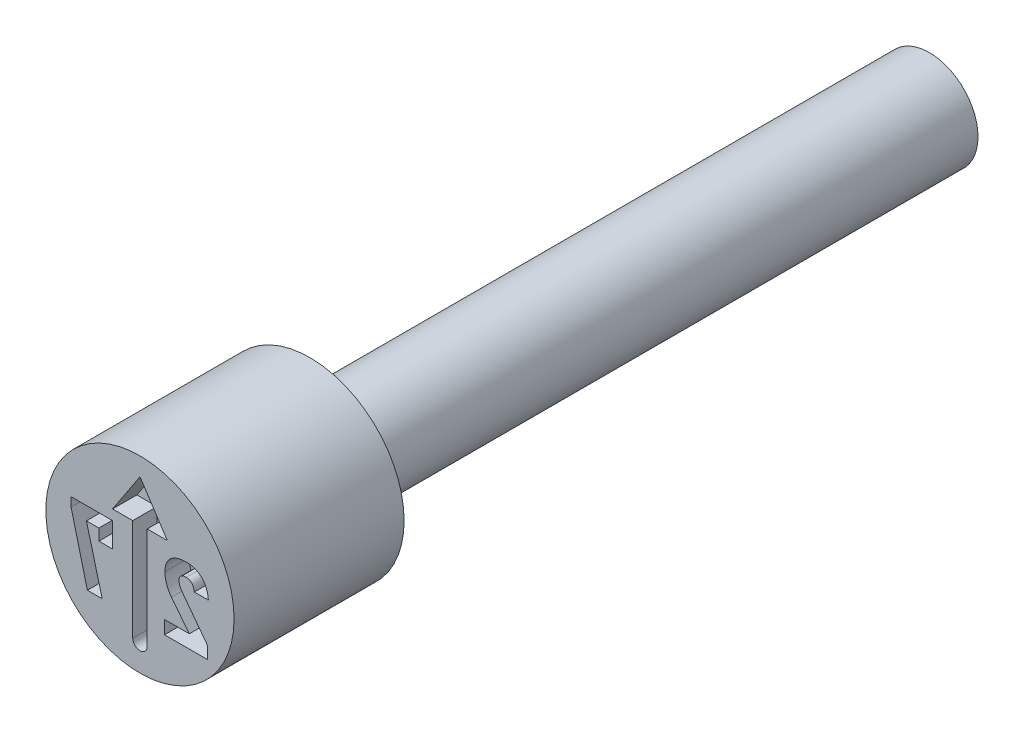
ISO-10303-21;
HEADER;
FILE_DESCRIPTION(('STEP AP214'),'2;1');
FILE_NAME('part.step','',(''),(''),'','','');
FILE_SCHEMA(('AUTOMOTIVE_DESIGN { 1 0 10303 214 1 1 1 1 }'));
ENDSEC;
DATA;
#1=APPLICATION_CONTEXT('core data for automotive mechanical design processes');
#2=APPLICATION_PROTOCOL_DEFINITION('international standard','automotive_design',2000,#1);
#3=PRODUCT_CONTEXT('',#1,'mechanical');
#4=PRODUCT('Part','Part','',(#3));
#5=PRODUCT_RELATED_PRODUCT_CATEGORY('part','',(#4));
#6=PRODUCT_DEFINITION_FORMATION('','',#4);
#7=PRODUCT_DEFINITION_CONTEXT('part definition',#1,'design');
#8=PRODUCT_DEFINITION('design','',#6,#7);
#9=PRODUCT_DEFINITION_SHAPE('','',#8);
#10=(LENGTH_UNIT() NAMED_UNIT(*) SI_UNIT(.MILLI.,.METRE.));
#11=(NAMED_UNIT(*) PLANE_ANGLE_UNIT() SI_UNIT($,.RADIAN.));
#12=(NAMED_UNIT(*) SI_UNIT($,.STERADIAN.) SOLID_ANGLE_UNIT());
#13=UNCERTAINTY_MEASURE_WITH_UNIT(LENGTH_MEASURE(1.E-05),#10,'distance_accuracy_value','');
#14=(GEOMETRIC_REPRESENTATION_CONTEXT(3) GLOBAL_UNCERTAINTY_ASSIGNED_CONTEXT((#13)) GLOBAL_UNIT_ASSIGNED_CONTEXT((#10,
#11,#12)) REPRESENTATION_CONTEXT('',''));
#15=CARTESIAN_POINT('',(0.,0.,0.));
#16=DIRECTION('',(0.,0.,1.));
#17=DIRECTION('',(1.,0.,0.));
#18=AXIS2_PLACEMENT_3D('',#15,#16,#17);
#19=CARTESIAN_POINT('',(0.,0.799999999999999,-2.8));
#20=DIRECTION('',(0.,0.,1.));
#21=DIRECTION('',(1.,0.,0.));
#22=AXIS2_PLACEMENT_3D('',#19,#20,#21);
#23=PLANE('',#22);
#24=CARTESIAN_POINT('',(0.,0.,-2.8));
#25=DIRECTION('',(0.,0.,1.));
#26=DIRECTION('',(1.,0.,0.));
#27=AXIS2_PLACEMENT_3D('',#24,#25,#26);
#28=CIRCLE('',#27,1.55);
#29=CARTESIAN_POINT('',(1.55,0.,-2.8));
#30=VERTEX_POINT('',#29);
#31=EDGE_CURVE('E11',#30,#30,#28,.T.);
#32=ORIENTED_EDGE('',*,*,#31,.F.);
#33=EDGE_LOOP('',(#32));
#34=FACE_BOUND('',#33,.T.);
#35=CARTESIAN_POINT('',(0.,0.,-2.8));
#36=DIRECTION('',(0.,0.,1.));
#37=DIRECTION('',(1.,0.,0.));
#38=AXIS2_PLACEMENT_3D('',#35,#36,#37);
#39=CIRCLE('',#38,0.799999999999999);
#40=CARTESIAN_POINT('',(0.799999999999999,0.,-2.8));
#41=VERTEX_POINT('',#40);
#42=EDGE_CURVE('E405',#41,#41,#39,.T.);
#43=ORIENTED_EDGE('',*,*,#42,.T.);
#44=EDGE_LOOP('',(#43));
#45=FACE_BOUND('',#44,.T.);
#46=ADVANCED_FACE('F39',(#34,#45),#23,.F.);
#47=CARTESIAN_POINT('',(0.,0.,-0.403888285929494));
#48=DIRECTION('',(0.,0.,1.));
#49=DIRECTION('',(1.,0.,0.));
#50=AXIS2_PLACEMENT_3D('',#47,#48,#49);
#51=CYLINDRICAL_SURFACE('',#50,1.55);
#52=CARTESIAN_POINT('',(0.,0.,0.));
#53=DIRECTION('',(0.,0.,1.));
#54=DIRECTION('',(1.,0.,0.));
#55=AXIS2_PLACEMENT_3D('',#52,#53,#54);
#56=CIRCLE('',#55,1.55);
#57=CARTESIAN_POINT('',(1.55,0.,0.));
#58=VERTEX_POINT('',#57);
#59=EDGE_CURVE('E46',#58,#58,#56,.T.);
#60=ORIENTED_EDGE('',*,*,#59,.F.);
#61=EDGE_LOOP('',(#60));
#62=FACE_BOUND('',#61,.T.);
#63=ORIENTED_EDGE('',*,*,#31,.T.);
#64=EDGE_LOOP('',(#63));
#65=FACE_BOUND('',#64,.T.);
#66=ADVANCED_FACE('F390',(#62,#65),#51,.T.);
#67=CARTESIAN_POINT('',(0.,1.55,0.));
#68=DIRECTION('',(0.,0.,-1.));
#69=DIRECTION('',(-1.,0.,0.));
#70=AXIS2_PLACEMENT_3D('',#67,#68,#69);
#71=PLANE('',#70);
#72=DIRECTION('',(0.,1.,0.));
#73=VECTOR('',#72,1.);
#74=CARTESIAN_POINT('',(1.11112012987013,-0.8,0.));
#75=LINE('',#74,#73);
#76=CARTESIAN_POINT('',(1.11112012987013,-0.8,0.));
#77=VERTEX_POINT('',#76);
#78=CARTESIAN_POINT('',(1.11112012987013,-0.595941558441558,0.));
#79=VERTEX_POINT('',#78);
#80=EDGE_CURVE('E640',#77,#79,#75,.T.);
#81=ORIENTED_EDGE('',*,*,#80,.F.);
#82=DIRECTION('',(1.,0.,0.));
#83=VECTOR('',#82,1.);
#84=CARTESIAN_POINT('',(0.404464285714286,-0.8,0.));
#85=LINE('',#84,#83);
#86=CARTESIAN_POINT('',(0.404464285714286,-0.8,0.));
#87=VERTEX_POINT('',#86);
#88=EDGE_CURVE('E53',#87,#77,#85,.T.);
#89=ORIENTED_EDGE('',*,*,#88,.F.);
#90=DIRECTION('',(0.,-1.,0.));
#91=VECTOR('',#90,1.);
#92=CARTESIAN_POINT('',(0.404464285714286,-0.581818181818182,0.));
#93=LINE('',#92,#91);
#94=CARTESIAN_POINT('',(0.404464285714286,-0.581818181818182,0.));
#95=VERTEX_POINT('',#94);
#96=EDGE_CURVE('E274',#95,#87,#93,.T.);
#97=ORIENTED_EDGE('',*,*,#96,.F.);
#98=DIRECTION('',(-1.,0.,0.));
#99=VECTOR('',#98,1.);
#100=CARTESIAN_POINT('',(0.812824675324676,-0.581818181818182,0.));
#101=LINE('',#100,#99);
#102=CARTESIAN_POINT('',(0.812824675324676,-0.581818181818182,0.));
#103=VERTEX_POINT('',#102);
#104=EDGE_CURVE('E277',#103,#95,#101,.T.);
#105=ORIENTED_EDGE('',*,*,#104,.F.);
#106=DIRECTION('',(0.618183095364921,-0.786034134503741,0.));
#107=VECTOR('',#106,1.);
#108=CARTESIAN_POINT('',(0.518668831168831,-0.207792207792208,0.));
#109=LINE('',#108,#107);
#110=CARTESIAN_POINT('',(0.518668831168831,-0.207792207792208,0.));
#111=VERTEX_POINT('',#110);
#112=EDGE_CURVE('E571',#111,#103,#109,.T.);
#113=ORIENTED_EDGE('',*,*,#112,.F.);
#114=CARTESIAN_POINT('',(0.411038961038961,0.100974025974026,0.));
#115=CARTESIAN_POINT('',(0.411349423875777,0.087320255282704,0.));
#116=CARTESIAN_POINT('',(0.411970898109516,0.0599885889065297,0.));
#117=CARTESIAN_POINT('',(0.417580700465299,0.019082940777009,0.));
#118=CARTESIAN_POINT('',(0.426620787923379,-0.0216138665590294,0.));
#119=CARTESIAN_POINT('',(0.439036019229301,-0.0619052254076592,0.));
#120=CARTESIAN_POINT('',(0.454458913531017,-0.101093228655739,0.));
#121=CARTESIAN_POINT('',(0.472969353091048,-0.138641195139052,0.));
#122=CARTESIAN_POINT('',(0.493860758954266,-0.174565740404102,0.));
#123=CARTESIAN_POINT('',(0.510415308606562,-0.196737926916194,0.));
#124=CARTESIAN_POINT('',(0.518668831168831,-0.207792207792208,0.));
#125=B_SPLINE_CURVE_WITH_KNOTS('',3,(#114,#115,#116,#117,#118,#119,#120,#121,#122,#123,#124),
.UNSPECIFIED.,.F.,.F.,(4,1,1,1,1,1,1,1,4),(0.,0.123046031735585,0.246309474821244,
0.371480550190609,0.498560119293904,0.626024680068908,0.750715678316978,0.875715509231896,1.),.UNSPECIFIED.);
#126=CARTESIAN_POINT('',(0.411038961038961,0.100974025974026,0.));
#127=VERTEX_POINT('',#126);
#128=EDGE_CURVE('E574',#127,#111,#125,.T.);
#129=ORIENTED_EDGE('',*,*,#128,.F.);
#130=DIRECTION('',(0.,-1.,0.));
#131=VECTOR('',#130,1.);
#132=CARTESIAN_POINT('',(0.411038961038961,0.101948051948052,0.));
#133=LINE('',#132,#131);
#134=CARTESIAN_POINT('',(0.411038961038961,0.101948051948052,0.));
#135=VERTEX_POINT('',#134);
#136=EDGE_CURVE('E579',#135,#127,#133,.T.);
#137=ORIENTED_EDGE('',*,*,#136,.F.);
#138=CARTESIAN_POINT('',(0.764366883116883,0.415584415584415,0.));
#139=CARTESIAN_POINT('',(0.750719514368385,0.415390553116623,0.));
#140=CARTESIAN_POINT('',(0.724177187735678,0.415013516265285,0.));
#141=CARTESIAN_POINT('',(0.685536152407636,0.410943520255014,0.));
#142=CARTESIAN_POINT('',(0.649179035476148,0.404800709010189,0.));
#143=CARTESIAN_POINT('',(0.615164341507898,0.395814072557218,0.));
#144=CARTESIAN_POINT('',(0.583628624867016,0.384091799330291,0.));
#145=CARTESIAN_POINT('',(0.554477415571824,0.369957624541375,0.));
#146=CARTESIAN_POINT('',(0.52764977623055,0.353291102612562,0.));
#147=CARTESIAN_POINT('',(0.503351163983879,0.33405660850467,0.));
#148=CARTESIAN_POINT('',(0.481488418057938,0.312603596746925,0.));
#149=CARTESIAN_POINT('',(0.462670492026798,0.288714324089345,0.));
#150=CARTESIAN_POINT('',(0.44638045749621,0.262871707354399,0.));
#151=CARTESIAN_POINT('',(0.433646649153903,0.2345745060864,0.));
#152=CARTESIAN_POINT('',(0.423163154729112,0.204488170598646,0.));
#153=CARTESIAN_POINT('',(0.416375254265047,0.172073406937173,0.));
#154=CARTESIAN_POINT('',(0.41180107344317,0.137711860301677,0.));
#155=CARTESIAN_POINT('',(0.411297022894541,0.114058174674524,0.));
#156=CARTESIAN_POINT('',(0.411038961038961,0.101948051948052,0.));
#157=B_SPLINE_CURVE_WITH_KNOTS('',3,(#138,#139,#140,#141,#142,#143,#144,#145,#146,#147,#148,
#149,#150,#151,#152,#153,#154,#155,#156),.UNSPECIFIED.,.F.,.F.,(4,1,1,1,1,1,1,1,1,1,1,1,1,1,1,1,
4),(0.,0.0762312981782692,0.148259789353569,0.216860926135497,0.28210063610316,
0.344528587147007,0.404571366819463,0.462840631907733,0.520642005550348,0.577409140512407,
0.633580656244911,0.690215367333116,0.747647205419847,0.806597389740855,0.867894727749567,
0.932365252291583,1.),.UNSPECIFIED.);
#158=CARTESIAN_POINT('',(0.764366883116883,0.415584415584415,0.));
#159=VERTEX_POINT('',#158);
#160=EDGE_CURVE('E585',#159,#135,#157,.T.);
#161=ORIENTED_EDGE('',*,*,#160,.F.);
#162=CARTESIAN_POINT('',(1.12597402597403,0.0554383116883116,0.));
#163=CARTESIAN_POINT('',(1.12483495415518,0.0693479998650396,0.));
#164=CARTESIAN_POINT('',(1.1226115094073,0.0964994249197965,0.));
#165=CARTESIAN_POINT('',(1.11532209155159,0.135775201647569,0.));
#166=CARTESIAN_POINT('',(1.10590080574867,0.17277029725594,0.));
#167=CARTESIAN_POINT('',(1.09391566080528,0.207477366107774,0.));
#168=CARTESIAN_POINT('',(1.07851470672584,0.239494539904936,0.));
#169=CARTESIAN_POINT('',(1.06121126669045,0.2694911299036,0.));
#170=CARTESIAN_POINT('',(1.04039956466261,0.296539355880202,0.));
#171=CARTESIAN_POINT('',(1.01761824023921,0.321544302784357,0.));
#172=CARTESIAN_POINT('',(0.992243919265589,0.343568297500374,0.));
#173=CARTESIAN_POINT('',(0.965187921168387,0.362996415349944,0.));
#174=CARTESIAN_POINT('',(0.936041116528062,0.379163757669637,0.));
#175=CARTESIAN_POINT('',(0.90524661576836,0.392575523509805,0.));
#176=CARTESIAN_POINT('',(0.87246299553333,0.402754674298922,0.));
#177=CARTESIAN_POINT('',(0.838118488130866,0.410379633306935,0.));
#178=CARTESIAN_POINT('',(0.80181888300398,0.414776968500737,0.));
#179=CARTESIAN_POINT('',(0.777040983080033,0.415311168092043,0.));
#180=CARTESIAN_POINT('',(0.764366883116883,0.415584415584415,0.));
#181=B_SPLINE_CURVE_WITH_KNOTS('',3,(#162,#163,#164,#165,#166,#167,#168,#169,#170,#171,#172,
#173,#174,#175,#176,#177,#178,#179,#180),.UNSPECIFIED.,.F.,.F.,(4,1,1,1,1,1,1,1,1,1,1,1,1,1,1,1,
4),(0.,0.0733268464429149,0.14313249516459,0.209679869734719,0.273918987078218,0.33576228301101,
0.396210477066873,0.45560885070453,0.514796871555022,0.573764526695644,0.631900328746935,
0.689592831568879,0.748648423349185,0.808163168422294,0.86976604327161,0.933384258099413,1.),.UNSPECIFIED.);
#182=CARTESIAN_POINT('',(1.12597402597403,0.0554383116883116,0.));
#183=VERTEX_POINT('',#182);
#184=EDGE_CURVE('E590',#183,#159,#181,.T.);
#185=ORIENTED_EDGE('',*,*,#184,.F.);
#186=DIRECTION('',(0.,1.,0.));
#187=VECTOR('',#186,1.);
#188=CARTESIAN_POINT('',(1.12597402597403,0.0547077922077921,0.));
#189=LINE('',#188,#187);
#190=CARTESIAN_POINT('',(1.12597402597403,0.0547077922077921,0.));
#191=VERTEX_POINT('',#190);
#192=EDGE_CURVE('E598',#191,#183,#189,.T.);
#193=ORIENTED_EDGE('',*,*,#192,.F.);
#194=DIRECTION('',(1.,0.,0.));
#195=VECTOR('',#194,1.);
#196=CARTESIAN_POINT('',(0.89512987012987,0.0547077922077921,0.));
#197=LINE('',#196,#195);
#198=CARTESIAN_POINT('',(0.89512987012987,0.0547077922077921,0.));
#199=VERTEX_POINT('',#198);
#200=EDGE_CURVE('E604',#199,#191,#197,.T.);
#201=ORIENTED_EDGE('',*,*,#200,.F.);
#202=DIRECTION('',(0.,-1.,0.));
#203=VECTOR('',#202,1.);
#204=CARTESIAN_POINT('',(0.89512987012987,0.0554383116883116,0.));
#205=LINE('',#204,#203);
#206=CARTESIAN_POINT('',(0.89512987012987,0.0554383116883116,0.));
#207=VERTEX_POINT('',#206);
#208=EDGE_CURVE('E607',#207,#199,#205,.T.);
#209=ORIENTED_EDGE('',*,*,#208,.F.);
#210=CARTESIAN_POINT('',(0.762662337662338,0.197402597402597,0.));
#211=CARTESIAN_POINT('',(0.771484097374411,0.197058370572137,0.));
#212=CARTESIAN_POINT('',(0.788625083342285,0.196389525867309,0.));
#213=CARTESIAN_POINT('',(0.812891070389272,0.188976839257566,0.));
#214=CARTESIAN_POINT('',(0.834757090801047,0.177349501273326,0.));
#215=CARTESIAN_POINT('',(0.853607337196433,0.160758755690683,0.));
#216=CARTESIAN_POINT('',(0.8692167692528,0.139928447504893,0.));
#217=CARTESIAN_POINT('',(0.881885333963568,0.115399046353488,0.));
#218=CARTESIAN_POINT('',(0.890489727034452,0.0867276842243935,0.));
#219=CARTESIAN_POINT('',(0.893533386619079,0.066203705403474,0.));
#220=CARTESIAN_POINT('',(0.89512987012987,0.0554383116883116,0.));
#221=B_SPLINE_CURVE_WITH_KNOTS('',3,(#210,#211,#212,#213,#214,#215,#216,#217,#218,#219,#220),
.UNSPECIFIED.,.F.,.F.,(4,1,1,1,1,1,1,1,4),(0.,0.122603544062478,0.238222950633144,
0.350089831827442,0.465559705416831,0.58502806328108,0.711014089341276,0.848418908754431,1.),.UNSPECIFIED.);
#222=CARTESIAN_POINT('',(0.762662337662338,0.197402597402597,0.));
#223=VERTEX_POINT('',#222);
#224=EDGE_CURVE('E610',#223,#207,#221,.T.);
#225=ORIENTED_EDGE('',*,*,#224,.F.);
#226=CARTESIAN_POINT('',(0.642857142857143,0.095616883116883,0.));
#227=CARTESIAN_POINT('',(0.643189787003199,0.103289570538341,0.));
#228=CARTESIAN_POINT('',(0.643827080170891,0.11798921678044,0.));
#229=CARTESIAN_POINT('',(0.649831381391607,0.138701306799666,0.));
#230=CARTESIAN_POINT('',(0.659672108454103,0.156738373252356,0.));
#231=CARTESIAN_POINT('',(0.673766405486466,0.171636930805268,0.));
#232=CARTESIAN_POINT('',(0.691312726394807,0.183420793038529,0.));
#233=CARTESIAN_POINT('',(0.712307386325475,0.191725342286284,0.));
#234=CARTESIAN_POINT('',(0.736475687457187,0.196487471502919,0.));
#235=CARTESIAN_POINT('',(0.753630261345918,0.197086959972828,0.));
#236=CARTESIAN_POINT('',(0.762662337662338,0.197402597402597,0.));
#237=B_SPLINE_CURVE_WITH_KNOTS('',3,(#226,#227,#228,#229,#230,#231,#232,#233,#234,#235,#236),
.UNSPECIFIED.,.F.,.F.,(4,1,1,1,1,1,1,1,4),(0.,0.128749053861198,0.246662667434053,
0.359069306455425,0.47107757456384,0.588039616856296,0.711712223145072,0.848213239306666,1.),.UNSPECIFIED.);
#238=CARTESIAN_POINT('',(0.642857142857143,0.095616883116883,0.));
#239=VERTEX_POINT('',#238);
#240=EDGE_CURVE('E615',#239,#223,#237,.T.);
#241=ORIENTED_EDGE('',*,*,#240,.F.);
#242=DIRECTION('',(0.,1.,0.));
#243=VECTOR('',#242,1.);
#244=CARTESIAN_POINT('',(0.642857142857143,0.0939123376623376,0.));
#245=LINE('',#244,#243);
#246=CARTESIAN_POINT('',(0.642857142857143,0.0939123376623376,0.));
#247=VERTEX_POINT('',#246);
#248=EDGE_CURVE('E623',#247,#239,#245,.T.);
#249=ORIENTED_EDGE('',*,*,#248,.F.);
#250=CARTESIAN_POINT('',(0.701055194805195,-0.0526785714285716,0.));
#251=CARTESIAN_POINT('',(0.692466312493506,-0.040576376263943,0.));
#252=CARTESIAN_POINT('',(0.675731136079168,-0.0169956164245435,0.));
#253=CARTESIAN_POINT('',(0.660584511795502,0.0153877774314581,0.));
#254=CARTESIAN_POINT('',(0.651148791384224,0.0407767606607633,0.));
#255=CARTESIAN_POINT('',(0.646651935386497,0.0591887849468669,0.));
#256=CARTESIAN_POINT('',(0.643444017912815,0.0767555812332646,0.));
#257=CARTESIAN_POINT('',(0.64304917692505,0.0882983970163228,0.));
#258=CARTESIAN_POINT('',(0.642857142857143,0.0939123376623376,0.));
#259=B_SPLINE_CURVE_WITH_KNOTS('',3,(#250,#251,#252,#253,#254,#255,#256,#257,#258),
.UNSPECIFIED.,.F.,.F.,(4,1,1,1,1,1,4),(0.,0.27737542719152,0.540457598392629,0.666416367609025,
0.784009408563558,0.894951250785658,1.),.UNSPECIFIED.);
#260=CARTESIAN_POINT('',(0.701055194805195,-0.0526785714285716,0.));
#261=VERTEX_POINT('',#260);
#262=EDGE_CURVE('E629',#261,#247,#259,.T.);
#263=ORIENTED_EDGE('',*,*,#262,.F.);
#264=DIRECTION('',(-0.602458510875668,0.798150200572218,0.));
#265=VECTOR('',#264,1.);
#266=CARTESIAN_POINT('',(1.11112012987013,-0.595941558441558,0.));
#267=LINE('',#266,#265);
#268=EDGE_CURVE('E634',#79,#261,#267,.T.);
#269=ORIENTED_EDGE('',*,*,#268,.F.);
#270=EDGE_LOOP('',(#81,#89,#97,#105,#113,#129,#137,#161,#185,#193,#201,#209,#225,#241,#249,#263,#269));
#271=FACE_BOUND('',#270,.T.);
#272=DIRECTION('',(0.,-1.,0.));
#273=VECTOR('',#272,1.);
#274=CARTESIAN_POINT('',(-1.13380519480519,0.4,0.));
#275=LINE('',#274,#273);
#276=CARTESIAN_POINT('',(-1.13380519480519,0.4,0.));
#277=VERTEX_POINT('',#276);
#278=CARTESIAN_POINT('',(-1.13380519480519,0.249512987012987,0.));
#279=VERTEX_POINT('',#278);
#280=EDGE_CURVE('E510',#277,#279,#275,.T.);
#281=ORIENTED_EDGE('',*,*,#280,.F.);
#282=DIRECTION('',(-1.,0.,0.));
#283=VECTOR('',#282,1.);
#284=CARTESIAN_POINT('',(-0.451012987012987,0.4,0.));
#285=LINE('',#284,#283);
#286=CARTESIAN_POINT('',(-0.451012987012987,0.4,0.));
#287=VERTEX_POINT('',#286);
#288=EDGE_CURVE('E61',#287,#277,#285,.T.);
#289=ORIENTED_EDGE('',*,*,#288,.F.);
#290=DIRECTION('',(0.,1.,0.));
#291=VECTOR('',#290,1.);
#292=CARTESIAN_POINT('',(-0.451012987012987,-0.00519480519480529,0.));
#293=LINE('',#292,#291);
#294=CARTESIAN_POINT('',(-0.451012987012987,-0.00519480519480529,0.));
#295=VERTEX_POINT('',#294);
#296=EDGE_CURVE('E488',#295,#287,#293,.T.);
#297=ORIENTED_EDGE('',*,*,#296,.F.);
#298=DIRECTION('',(1.,0.,0.));
#299=VECTOR('',#298,1.);
#300=CARTESIAN_POINT('',(-0.676256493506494,-0.00519480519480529,0.));
#301=LINE('',#300,#299);
#302=CARTESIAN_POINT('',(-0.676256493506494,-0.00519480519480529,0.));
#303=VERTEX_POINT('',#302);
#304=EDGE_CURVE('E492',#303,#295,#301,.T.);
#305=ORIENTED_EDGE('',*,*,#304,.F.);
#306=DIRECTION('',(0.,-1.,0.));
#307=VECTOR('',#306,1.);
#308=CARTESIAN_POINT('',(-0.676256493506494,0.181818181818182,0.));
#309=LINE('',#308,#307);
#310=CARTESIAN_POINT('',(-0.676256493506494,0.181818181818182,0.));
#311=VERTEX_POINT('',#310);
#312=EDGE_CURVE('E495',#311,#303,#309,.T.);
#313=ORIENTED_EDGE('',*,*,#312,.F.);
#314=DIRECTION('',(1.,0.,0.));
#315=VECTOR('',#314,1.);
#316=CARTESIAN_POINT('',(-0.881532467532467,0.181818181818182,0.));
#317=LINE('',#316,#315);
#318=CARTESIAN_POINT('',(-0.881532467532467,0.181818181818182,0.));
#319=VERTEX_POINT('',#318);
#320=EDGE_CURVE('E498',#319,#311,#317,.T.);
#321=ORIENTED_EDGE('',*,*,#320,.F.);
#322=DIRECTION('',(-0.255602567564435,0.966781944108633,0.));
#323=VECTOR('',#322,1.);
#324=CARTESIAN_POINT('',(-0.621954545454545,-0.8,0.));
#325=LINE('',#324,#323);
#326=CARTESIAN_POINT('',(-0.621954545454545,-0.8,0.));
#327=VERTEX_POINT('',#326);
#328=EDGE_CURVE('E501',#327,#319,#325,.T.);
#329=ORIENTED_EDGE('',*,*,#328,.F.);
#330=DIRECTION('',(1.,0.,0.));
#331=VECTOR('',#330,1.);
#332=CARTESIAN_POINT('',(-0.865948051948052,-0.8,0.));
#333=LINE('',#332,#331);
#334=CARTESIAN_POINT('',(-0.865948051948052,-0.8,0.));
#335=VERTEX_POINT('',#334);
#336=EDGE_CURVE('E504',#335,#327,#333,.T.);
#337=ORIENTED_EDGE('',*,*,#336,.F.);
#338=DIRECTION('',(0.247293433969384,-0.968940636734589,0.));
#339=VECTOR('',#338,1.);
#340=CARTESIAN_POINT('',(-1.13380519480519,0.249512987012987,0.));
#341=LINE('',#340,#339);
#342=EDGE_CURVE('E507',#279,#335,#341,.T.);
#343=ORIENTED_EDGE('',*,*,#342,.F.);
#344=EDGE_LOOP('',(#281,#289,#297,#305,#313,#321,#329,#337,#343));
#345=FACE_BOUND('',#344,.T.);
#346=DIRECTION('',(0.,1.,0.));
#347=VECTOR('',#346,1.);
#348=CARTESIAN_POINT('',(0.119045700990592,0.566469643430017,0.));
#349=LINE('',#348,#347);
#350=CARTESIAN_POINT('',(0.119045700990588,-1.11010114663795,0.));
#351=VERTEX_POINT('',#350);
#352=CARTESIAN_POINT('',(0.119045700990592,0.566469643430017,0.));
#353=VERTEX_POINT('',#352);
#354=EDGE_CURVE('E444',#351,#353,#349,.T.);
#355=ORIENTED_EDGE('',*,*,#354,.F.);
#356=CARTESIAN_POINT('',(1.02140308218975E-13,-1.11010114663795,0.));
#357=DIRECTION('',(0.,0.,1.));
#358=DIRECTION('',(1.,0.,0.));
#359=AXIS2_PLACEMENT_3D('',#356,#357,#358);
#360=CIRCLE('',#359,0.119045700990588);
#361=CARTESIAN_POINT('',(-0.119045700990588,-1.11010114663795,0.));
#362=VERTEX_POINT('',#361);
#363=EDGE_CURVE('E447',#362,#351,#360,.T.);
#364=ORIENTED_EDGE('',*,*,#363,.F.);
#365=DIRECTION('',(0.,-1.,0.));
#366=VECTOR('',#365,1.);
#367=CARTESIAN_POINT('',(-0.119045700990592,0.566469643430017,0.));
#368=LINE('',#367,#366);
#369=CARTESIAN_POINT('',(-0.119045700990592,0.566469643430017,0.));
#370=VERTEX_POINT('',#369);
#371=EDGE_CURVE('E428',#370,#362,#368,.T.);
#372=ORIENTED_EDGE('',*,*,#371,.F.);
#373=DIRECTION('',(1.,0.,0.));
#374=VECTOR('',#373,1.);
#375=CARTESIAN_POINT('',(-0.451198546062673,0.566469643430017,0.));
#376=LINE('',#375,#374);
#377=CARTESIAN_POINT('',(-0.451198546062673,0.566469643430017,0.));
#378=VERTEX_POINT('',#377);
#379=EDGE_CURVE('E432',#378,#370,#376,.T.);
#380=ORIENTED_EDGE('',*,*,#379,.F.);
#381=DIRECTION('',(-0.550159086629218,-0.835059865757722,0.));
#382=VECTOR('',#381,1.);
#383=CARTESIAN_POINT('',(0.,1.25132209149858,0.));
#384=LINE('',#383,#382);
#385=CARTESIAN_POINT('',(0.,1.25132209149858,0.));
#386=VERTEX_POINT('',#385);
#387=EDGE_CURVE('E435',#386,#378,#384,.T.);
#388=ORIENTED_EDGE('',*,*,#387,.F.);
#389=DIRECTION('',(-0.550159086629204,0.835059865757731,0.));
#390=VECTOR('',#389,1.);
#391=CARTESIAN_POINT('',(0.,1.25132209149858,0.));
#392=LINE('',#391,#390);
#393=CARTESIAN_POINT('',(0.451198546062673,0.566469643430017,0.));
#394=VERTEX_POINT('',#393);
#395=EDGE_CURVE('E438',#394,#386,#392,.T.);
#396=ORIENTED_EDGE('',*,*,#395,.F.);
#397=DIRECTION('',(1.,0.,0.));
#398=VECTOR('',#397,1.);
#399=CARTESIAN_POINT('',(0.451198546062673,0.566469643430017,0.));
#400=LINE('',#399,#398);
#401=EDGE_CURVE('E441',#353,#394,#400,.T.);
#402=ORIENTED_EDGE('',*,*,#401,.F.);
#403=EDGE_LOOP('',(#355,#364,#372,#380,#388,#396,#402));
#404=FACE_BOUND('',#403,.T.);
#405=ORIENTED_EDGE('',*,*,#59,.T.);
#406=EDGE_LOOP('',(#405));
#407=FACE_BOUND('',#406,.T.);
#408=ADVANCED_FACE('F387',(#271,#345,#404,#407),#71,.F.);
#409=CARTESIAN_POINT('',(0.,0.,-13.));
#410=DIRECTION('',(0.,0.,1.));
#411=DIRECTION('',(1.,0.,0.));
#412=AXIS2_PLACEMENT_3D('',#409,#410,#411);
#413=PLANE('',#412);
#414=CARTESIAN_POINT('',(0.,0.,-13.));
#415=DIRECTION('',(0.,0.,1.));
#416=DIRECTION('',(1.,0.,0.));
#417=AXIS2_PLACEMENT_3D('',#414,#415,#416);
#418=CIRCLE('',#417,0.8);
#419=CARTESIAN_POINT('',(0.8,0.,-13.));
#420=VERTEX_POINT('',#419);
#421=EDGE_CURVE('E406',#420,#420,#418,.T.);
#422=ORIENTED_EDGE('',*,*,#421,.F.);
#423=EDGE_LOOP('',(#422));
#424=FACE_BOUND('',#423,.T.);
#425=ADVANCED_FACE('F383',(#424),#413,.F.);
#426=CARTESIAN_POINT('',(0.,0.,-0.403888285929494));
#427=DIRECTION('',(0.,0.,1.));
#428=DIRECTION('',(1.,0.,0.));
#429=AXIS2_PLACEMENT_3D('',#426,#427,#428);
#430=CYLINDRICAL_SURFACE('',#429,0.8);
#431=ORIENTED_EDGE('',*,*,#42,.F.);
#432=EDGE_LOOP('',(#431));
#433=FACE_BOUND('',#432,.T.);
#434=ORIENTED_EDGE('',*,*,#421,.T.);
#435=EDGE_LOOP('',(#434));
#436=FACE_BOUND('',#435,.T.);
#437=ADVANCED_FACE('F379',(#433,#436),#430,.T.);
#438=CARTESIAN_POINT('',(1.02140308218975E-13,-1.11010114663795,-0.4));
#439=DIRECTION('',(0.,0.,1.));
#440=DIRECTION('',(1.,0.,0.));
#441=AXIS2_PLACEMENT_3D('',#438,#439,#440);
#442=CYLINDRICAL_SURFACE('',#441,0.119045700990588);
#443=ORIENTED_EDGE('',*,*,#363,.T.);
#444=DIRECTION('',(0.,0.,1.));
#445=VECTOR('',#444,1.);
#446=CARTESIAN_POINT('',(0.119045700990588,-1.11010114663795,-0.4));
#447=LINE('',#446,#445);
#448=CARTESIAN_POINT('',(0.119045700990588,-1.11010114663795,-0.4));
#449=VERTEX_POINT('',#448);
#450=EDGE_CURVE('E414',#449,#351,#447,.T.);
#451=ORIENTED_EDGE('',*,*,#450,.F.);
#452=CARTESIAN_POINT('',(1.02140308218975E-13,-1.11010114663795,-0.4));
#453=DIRECTION('',(0.,0.,1.));
#454=DIRECTION('',(1.,0.,0.));
#455=AXIS2_PLACEMENT_3D('',#452,#453,#454);
#456=CIRCLE('',#455,0.119045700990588);
#457=CARTESIAN_POINT('',(-0.119045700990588,-1.11010114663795,-0.4));
#458=VERTEX_POINT('',#457);
#459=EDGE_CURVE('E431',#458,#449,#456,.T.);
#460=ORIENTED_EDGE('',*,*,#459,.F.);
#461=DIRECTION('',(0.,0.,1.));
#462=VECTOR('',#461,1.);
#463=CARTESIAN_POINT('',(-0.119045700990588,-1.11010114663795,-0.4));
#464=LINE('',#463,#462);
#465=EDGE_CURVE('E407',#458,#362,#464,.T.);
#466=ORIENTED_EDGE('',*,*,#465,.T.);
#467=EDGE_LOOP('',(#443,#451,#460,#466));
#468=FACE_BOUND('',#467,.T.);
#469=ADVANCED_FACE('F357',(#468),#442,.F.);
#470=CARTESIAN_POINT('',(-0.119045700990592,0.566469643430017,-0.4));
#471=DIRECTION('',(-1.,0.,0.));
#472=DIRECTION('',(0.,-1.,0.));
#473=AXIS2_PLACEMENT_3D('',#470,#471,#472);
#474=PLANE('',#473);
#475=ORIENTED_EDGE('',*,*,#371,.T.);
#476=ORIENTED_EDGE('',*,*,#465,.F.);
#477=DIRECTION('',(0.,-1.,0.));
#478=VECTOR('',#477,1.);
#479=CARTESIAN_POINT('',(-0.119045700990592,0.566469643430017,-0.4));
#480=LINE('',#479,#478);
#481=CARTESIAN_POINT('',(-0.119045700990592,0.566469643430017,-0.4));
#482=VERTEX_POINT('',#481);
#483=EDGE_CURVE('E419',#482,#458,#480,.T.);
#484=ORIENTED_EDGE('',*,*,#483,.F.);
#485=DIRECTION('',(0.,0.,1.));
#486=VECTOR('',#485,1.);
#487=CARTESIAN_POINT('',(-0.119045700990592,0.566469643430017,-0.4));
#488=LINE('',#487,#486);
#489=EDGE_CURVE('E411',#482,#370,#488,.T.);
#490=ORIENTED_EDGE('',*,*,#489,.T.);
#491=EDGE_LOOP('',(#475,#476,#484,#490));
#492=FACE_BOUND('',#491,.T.);
#493=ADVANCED_FACE('F353',(#492),#474,.F.);
#494=CARTESIAN_POINT('',(-0.451198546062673,0.566469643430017,-0.4));
#495=DIRECTION('',(0.,-1.,0.));
#496=DIRECTION('',(0.,0.,-1.));
#497=AXIS2_PLACEMENT_3D('',#494,#495,#496);
#498=PLANE('',#497);
#499=ORIENTED_EDGE('',*,*,#379,.T.);
#500=ORIENTED_EDGE('',*,*,#489,.F.);
#501=DIRECTION('',(1.,0.,0.));
#502=VECTOR('',#501,1.);
#503=CARTESIAN_POINT('',(-0.451198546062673,0.566469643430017,-0.4));
#504=LINE('',#503,#502);
#505=CARTESIAN_POINT('',(-0.451198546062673,0.566469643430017,-0.4));
#506=VERTEX_POINT('',#505);
#507=EDGE_CURVE('E452',#506,#482,#504,.T.);
#508=ORIENTED_EDGE('',*,*,#507,.F.);
#509=DIRECTION('',(0.,0.,1.));
#510=VECTOR('',#509,1.);
#511=CARTESIAN_POINT('',(-0.451198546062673,0.566469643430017,-0.4));
#512=LINE('',#511,#510);
#513=EDGE_CURVE('E425',#506,#378,#512,.T.);
#514=ORIENTED_EDGE('',*,*,#513,.T.);
#515=EDGE_LOOP('',(#499,#500,#508,#514));
#516=FACE_BOUND('',#515,.T.);
#517=ADVANCED_FACE('F356',(#516),#498,.F.);
#518=CARTESIAN_POINT('',(0.,1.25132209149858,-0.4));
#519=DIRECTION('',(-0.835059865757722,0.550159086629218,0.));
#520=DIRECTION('',(-0.550159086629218,-0.835059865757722,0.));
#521=AXIS2_PLACEMENT_3D('',#518,#519,#520);
#522=PLANE('',#521);
#523=ORIENTED_EDGE('',*,*,#387,.T.);
#524=ORIENTED_EDGE('',*,*,#513,.F.);
#525=DIRECTION('',(-0.550159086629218,-0.835059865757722,0.));
#526=VECTOR('',#525,1.);
#527=CARTESIAN_POINT('',(0.,1.25132209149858,-0.4));
#528=LINE('',#527,#526);
#529=CARTESIAN_POINT('',(0.,1.25132209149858,-0.4));
#530=VERTEX_POINT('',#529);
#531=EDGE_CURVE('E455',#530,#506,#528,.T.);
#532=ORIENTED_EDGE('',*,*,#531,.F.);
#533=DIRECTION('',(0.,0.,1.));
#534=VECTOR('',#533,1.);
#535=CARTESIAN_POINT('',(0.,1.25132209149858,-0.4));
#536=LINE('',#535,#534);
#537=EDGE_CURVE('E423',#530,#386,#536,.T.);
#538=ORIENTED_EDGE('',*,*,#537,.T.);
#539=EDGE_LOOP('',(#523,#524,#532,#538));
#540=FACE_BOUND('',#539,.T.);
#541=ADVANCED_FACE('F361',(#540),#522,.F.);
#542=CARTESIAN_POINT('',(0.,1.25132209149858,-0.4));
#543=DIRECTION('',(0.835059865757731,0.550159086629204,0.));
#544=DIRECTION('',(-0.550159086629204,0.835059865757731,0.));
#545=AXIS2_PLACEMENT_3D('',#542,#543,#544);
#546=PLANE('',#545);
#547=ORIENTED_EDGE('',*,*,#395,.T.);
#548=ORIENTED_EDGE('',*,*,#537,.F.);
#549=DIRECTION('',(-0.550159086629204,0.835059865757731,0.));
#550=VECTOR('',#549,1.);
#551=CARTESIAN_POINT('',(0.,1.25132209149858,-0.4));
#552=LINE('',#551,#550);
#553=CARTESIAN_POINT('',(0.451198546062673,0.566469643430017,-0.4));
#554=VERTEX_POINT('',#553);
#555=EDGE_CURVE('E458',#554,#530,#552,.T.);
#556=ORIENTED_EDGE('',*,*,#555,.F.);
#557=DIRECTION('',(0.,0.,1.));
#558=VECTOR('',#557,1.);
#559=CARTESIAN_POINT('',(0.451198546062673,0.566469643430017,-0.4));
#560=LINE('',#559,#558);
#561=EDGE_CURVE('E421',#554,#394,#560,.T.);
#562=ORIENTED_EDGE('',*,*,#561,.T.);
#563=EDGE_LOOP('',(#547,#548,#556,#562));
#564=FACE_BOUND('',#563,.T.);
#565=ADVANCED_FACE('F365',(#564),#546,.F.);
#566=CARTESIAN_POINT('',(0.451198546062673,0.566469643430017,-0.4));
#567=DIRECTION('',(0.,-1.,0.));
#568=DIRECTION('',(0.,0.,-1.));
#569=AXIS2_PLACEMENT_3D('',#566,#567,#568);
#570=PLANE('',#569);
#571=ORIENTED_EDGE('',*,*,#401,.T.);
#572=ORIENTED_EDGE('',*,*,#561,.F.);
#573=DIRECTION('',(1.,0.,0.));
#574=VECTOR('',#573,1.);
#575=CARTESIAN_POINT('',(0.451198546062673,0.566469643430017,-0.4));
#576=LINE('',#575,#574);
#577=CARTESIAN_POINT('',(0.119045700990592,0.566469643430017,-0.4));
#578=VERTEX_POINT('',#577);
#579=EDGE_CURVE('E461',#578,#554,#576,.T.);
#580=ORIENTED_EDGE('',*,*,#579,.F.);
#581=DIRECTION('',(0.,0.,1.));
#582=VECTOR('',#581,1.);
#583=CARTESIAN_POINT('',(0.119045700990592,0.566469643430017,-0.4));
#584=LINE('',#583,#582);
#585=EDGE_CURVE('E418',#578,#353,#584,.T.);
#586=ORIENTED_EDGE('',*,*,#585,.T.);
#587=EDGE_LOOP('',(#571,#572,#580,#586));
#588=FACE_BOUND('',#587,.T.);
#589=ADVANCED_FACE('F369',(#588),#570,.F.);
#590=CARTESIAN_POINT('',(0.119045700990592,0.566469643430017,-0.4));
#591=DIRECTION('',(1.,0.,0.));
#592=DIRECTION('',(0.,1.,0.));
#593=AXIS2_PLACEMENT_3D('',#590,#591,#592);
#594=PLANE('',#593);
#595=ORIENTED_EDGE('',*,*,#354,.T.);
#596=ORIENTED_EDGE('',*,*,#585,.F.);
#597=DIRECTION('',(0.,1.,0.));
#598=VECTOR('',#597,1.);
#599=CARTESIAN_POINT('',(0.119045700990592,0.566469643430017,-0.4));
#600=LINE('',#599,#598);
#601=EDGE_CURVE('E464',#449,#578,#600,.T.);
#602=ORIENTED_EDGE('',*,*,#601,.F.);
#603=ORIENTED_EDGE('',*,*,#450,.T.);
#604=EDGE_LOOP('',(#595,#596,#602,#603));
#605=FACE_BOUND('',#604,.T.);
#606=ADVANCED_FACE('F351',(#605),#594,.F.);
#607=CARTESIAN_POINT('',(1.02140308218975E-13,-1.11010114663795,-0.4));
#608=DIRECTION('',(0.,0.,1.));
#609=DIRECTION('',(1.,0.,0.));
#610=AXIS2_PLACEMENT_3D('',#607,#608,#609);
#611=PLANE('',#610);
#612=ORIENTED_EDGE('',*,*,#459,.T.);
#613=ORIENTED_EDGE('',*,*,#601,.T.);
#614=ORIENTED_EDGE('',*,*,#579,.T.);
#615=ORIENTED_EDGE('',*,*,#555,.T.);
#616=ORIENTED_EDGE('',*,*,#531,.T.);
#617=ORIENTED_EDGE('',*,*,#507,.T.);
#618=ORIENTED_EDGE('',*,*,#483,.T.);
#619=EDGE_LOOP('',(#612,#613,#614,#615,#616,#617,#618));
#620=FACE_BOUND('',#619,.T.);
#621=ADVANCED_FACE('F348',(#620),#611,.T.);
#622=CARTESIAN_POINT('',(-0.451012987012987,0.4,-0.4));
#623=DIRECTION('',(0.,1.,0.));
#624=DIRECTION('',(0.,0.,1.));
#625=AXIS2_PLACEMENT_3D('',#622,#623,#624);
#626=PLANE('',#625);
#627=ORIENTED_EDGE('',*,*,#288,.T.);
#628=DIRECTION('',(0.,0.,1.));
#629=VECTOR('',#628,1.);
#630=CARTESIAN_POINT('',(-1.13380519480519,0.4,-0.4));
#631=LINE('',#630,#629);
#632=CARTESIAN_POINT('',(-1.13380519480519,0.4,-0.4));
#633=VERTEX_POINT('',#632);
#634=EDGE_CURVE('E469',#633,#277,#631,.T.);
#635=ORIENTED_EDGE('',*,*,#634,.F.);
#636=DIRECTION('',(-1.,0.,0.));
#637=VECTOR('',#636,1.);
#638=CARTESIAN_POINT('',(-0.451012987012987,0.4,-0.4));
#639=LINE('',#638,#637);
#640=CARTESIAN_POINT('',(-0.451012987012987,0.4,-0.4));
#641=VERTEX_POINT('',#640);
#642=EDGE_CURVE('E491',#641,#633,#639,.T.);
#643=ORIENTED_EDGE('',*,*,#642,.F.);
#644=DIRECTION('',(0.,0.,1.));
#645=VECTOR('',#644,1.);
#646=CARTESIAN_POINT('',(-0.451012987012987,0.4,-0.4));
#647=LINE('',#646,#645);
#648=EDGE_CURVE('E486',#641,#287,#647,.T.);
#649=ORIENTED_EDGE('',*,*,#648,.T.);
#650=EDGE_LOOP('',(#627,#635,#643,#649));
#651=FACE_BOUND('',#650,.T.);
#652=ADVANCED_FACE('F318',(#651),#626,.F.);
#653=CARTESIAN_POINT('',(-0.451012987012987,-0.00519480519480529,-0.4));
#654=DIRECTION('',(1.,0.,0.));
#655=DIRECTION('',(0.,0.,-1.));
#656=AXIS2_PLACEMENT_3D('',#653,#654,#655);
#657=PLANE('',#656);
#658=ORIENTED_EDGE('',*,*,#296,.T.);
#659=ORIENTED_EDGE('',*,*,#648,.F.);
#660=DIRECTION('',(0.,1.,0.));
#661=VECTOR('',#660,1.);
#662=CARTESIAN_POINT('',(-0.451012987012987,-0.00519480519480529,-0.4));
#663=LINE('',#662,#661);
#664=CARTESIAN_POINT('',(-0.451012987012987,-0.00519480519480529,-0.4));
#665=VERTEX_POINT('',#664);
#666=EDGE_CURVE('E472',#665,#641,#663,.T.);
#667=ORIENTED_EDGE('',*,*,#666,.F.);
#668=DIRECTION('',(0.,0.,1.));
#669=VECTOR('',#668,1.);
#670=CARTESIAN_POINT('',(-0.451012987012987,-0.00519480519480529,-0.4));
#671=LINE('',#670,#669);
#672=EDGE_CURVE('E484',#665,#295,#671,.T.);
#673=ORIENTED_EDGE('',*,*,#672,.T.);
#674=EDGE_LOOP('',(#658,#659,#667,#673));
#675=FACE_BOUND('',#674,.T.);
#676=ADVANCED_FACE('F314',(#675),#657,.F.);
#677=CARTESIAN_POINT('',(-0.676256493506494,-0.00519480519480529,-0.4));
#678=DIRECTION('',(0.,-1.,0.));
#679=DIRECTION('',(0.,0.,-1.));
#680=AXIS2_PLACEMENT_3D('',#677,#678,#679);
#681=PLANE('',#680);
#682=ORIENTED_EDGE('',*,*,#304,.T.);
#683=ORIENTED_EDGE('',*,*,#672,.F.);
#684=DIRECTION('',(1.,0.,0.));
#685=VECTOR('',#684,1.);
#686=CARTESIAN_POINT('',(-0.676256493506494,-0.00519480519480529,-0.4));
#687=LINE('',#686,#685);
#688=CARTESIAN_POINT('',(-0.676256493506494,-0.00519480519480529,-0.4));
#689=VERTEX_POINT('',#688);
#690=EDGE_CURVE('E516',#689,#665,#687,.T.);
#691=ORIENTED_EDGE('',*,*,#690,.F.);
#692=DIRECTION('',(0.,0.,1.));
#693=VECTOR('',#692,1.);
#694=CARTESIAN_POINT('',(-0.676256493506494,-0.00519480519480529,-0.4));
#695=LINE('',#694,#693);
#696=EDGE_CURVE('E482',#689,#303,#695,.T.);
#697=ORIENTED_EDGE('',*,*,#696,.T.);
#698=EDGE_LOOP('',(#682,#683,#691,#697));
#699=FACE_BOUND('',#698,.T.);
#700=ADVANCED_FACE('F317',(#699),#681,.F.);
#701=CARTESIAN_POINT('',(-0.676256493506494,0.181818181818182,-0.4));
#702=DIRECTION('',(-1.,0.,0.));
#703=DIRECTION('',(0.,0.,1.));
#704=AXIS2_PLACEMENT_3D('',#701,#702,#703);
#705=PLANE('',#704);
#706=ORIENTED_EDGE('',*,*,#312,.T.);
#707=ORIENTED_EDGE('',*,*,#696,.F.);
#708=DIRECTION('',(0.,-1.,0.));
#709=VECTOR('',#708,1.);
#710=CARTESIAN_POINT('',(-0.676256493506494,0.181818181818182,-0.4));
#711=LINE('',#710,#709);
#712=CARTESIAN_POINT('',(-0.676256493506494,0.181818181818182,-0.4));
#713=VERTEX_POINT('',#712);
#714=EDGE_CURVE('E519',#713,#689,#711,.T.);
#715=ORIENTED_EDGE('',*,*,#714,.F.);
#716=DIRECTION('',(0.,0.,1.));
#717=VECTOR('',#716,1.);
#718=CARTESIAN_POINT('',(-0.676256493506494,0.181818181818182,-0.4));
#719=LINE('',#718,#717);
#720=EDGE_CURVE('E480',#713,#311,#719,.T.);
#721=ORIENTED_EDGE('',*,*,#720,.T.);
#722=EDGE_LOOP('',(#706,#707,#715,#721));
#723=FACE_BOUND('',#722,.T.);
#724=ADVANCED_FACE('F322',(#723),#705,.F.);
#725=CARTESIAN_POINT('',(-0.881532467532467,0.181818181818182,-0.4));
#726=DIRECTION('',(0.,-1.,0.));
#727=DIRECTION('',(0.,0.,-1.));
#728=AXIS2_PLACEMENT_3D('',#725,#726,#727);
#729=PLANE('',#728);
#730=ORIENTED_EDGE('',*,*,#320,.T.);
#731=ORIENTED_EDGE('',*,*,#720,.F.);
#732=DIRECTION('',(1.,0.,0.));
#733=VECTOR('',#732,1.);
#734=CARTESIAN_POINT('',(-0.881532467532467,0.181818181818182,-0.4));
#735=LINE('',#734,#733);
#736=CARTESIAN_POINT('',(-0.881532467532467,0.181818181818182,-0.4));
#737=VERTEX_POINT('',#736);
#738=EDGE_CURVE('E522',#737,#713,#735,.T.);
#739=ORIENTED_EDGE('',*,*,#738,.F.);
#740=DIRECTION('',(0.,0.,1.));
#741=VECTOR('',#740,1.);
#742=CARTESIAN_POINT('',(-0.881532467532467,0.181818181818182,-0.4));
#743=LINE('',#742,#741);
#744=EDGE_CURVE('E478',#737,#319,#743,.T.);
#745=ORIENTED_EDGE('',*,*,#744,.T.);
#746=EDGE_LOOP('',(#730,#731,#739,#745));
#747=FACE_BOUND('',#746,.T.);
#748=ADVANCED_FACE('F326',(#747),#729,.F.);
#749=CARTESIAN_POINT('',(-0.621954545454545,-0.8,-0.4));
#750=DIRECTION('',(0.966781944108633,0.255602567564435,0.));
#751=DIRECTION('',(-0.255602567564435,0.966781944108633,0.));
#752=AXIS2_PLACEMENT_3D('',#749,#750,#751);
#753=PLANE('',#752);
#754=ORIENTED_EDGE('',*,*,#328,.T.);
#755=ORIENTED_EDGE('',*,*,#744,.F.);
#756=DIRECTION('',(-0.255602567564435,0.966781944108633,0.));
#757=VECTOR('',#756,1.);
#758=CARTESIAN_POINT('',(-0.621954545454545,-0.8,-0.4));
#759=LINE('',#758,#757);
#760=CARTESIAN_POINT('',(-0.621954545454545,-0.8,-0.4));
#761=VERTEX_POINT('',#760);
#762=EDGE_CURVE('E525',#761,#737,#759,.T.);
#763=ORIENTED_EDGE('',*,*,#762,.F.);
#764=DIRECTION('',(0.,0.,1.));
#765=VECTOR('',#764,1.);
#766=CARTESIAN_POINT('',(-0.621954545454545,-0.8,-0.4));
#767=LINE('',#766,#765);
#768=EDGE_CURVE('E476',#761,#327,#767,.T.);
#769=ORIENTED_EDGE('',*,*,#768,.T.);
#770=EDGE_LOOP('',(#754,#755,#763,#769));
#771=FACE_BOUND('',#770,.T.);
#772=ADVANCED_FACE('F330',(#771),#753,.F.);
#773=CARTESIAN_POINT('',(-0.865948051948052,-0.8,-0.4));
#774=DIRECTION('',(0.,-1.,0.));
#775=DIRECTION('',(0.,0.,-1.));
#776=AXIS2_PLACEMENT_3D('',#773,#774,#775);
#777=PLANE('',#776);
#778=ORIENTED_EDGE('',*,*,#336,.T.);
#779=ORIENTED_EDGE('',*,*,#768,.F.);
#780=DIRECTION('',(1.,0.,0.));
#781=VECTOR('',#780,1.);
#782=CARTESIAN_POINT('',(-0.865948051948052,-0.8,-0.4));
#783=LINE('',#782,#781);
#784=CARTESIAN_POINT('',(-0.865948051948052,-0.8,-0.4));
#785=VERTEX_POINT('',#784);
#786=EDGE_CURVE('E528',#785,#761,#783,.T.);
#787=ORIENTED_EDGE('',*,*,#786,.F.);
#788=DIRECTION('',(0.,0.,1.));
#789=VECTOR('',#788,1.);
#790=CARTESIAN_POINT('',(-0.865948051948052,-0.8,-0.4));
#791=LINE('',#790,#789);
#792=EDGE_CURVE('E474',#785,#335,#791,.T.);
#793=ORIENTED_EDGE('',*,*,#792,.T.);
#794=EDGE_LOOP('',(#778,#779,#787,#793));
#795=FACE_BOUND('',#794,.T.);
#796=ADVANCED_FACE('F334',(#795),#777,.F.);
#797=CARTESIAN_POINT('',(-1.13380519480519,0.249512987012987,-0.4));
#798=DIRECTION('',(-0.968940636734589,-0.247293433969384,0.));
#799=DIRECTION('',(0.247293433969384,-0.968940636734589,0.));
#800=AXIS2_PLACEMENT_3D('',#797,#798,#799);
#801=PLANE('',#800);
#802=ORIENTED_EDGE('',*,*,#342,.T.);
#803=ORIENTED_EDGE('',*,*,#792,.F.);
#804=DIRECTION('',(0.247293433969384,-0.968940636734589,0.));
#805=VECTOR('',#804,1.);
#806=CARTESIAN_POINT('',(-1.13380519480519,0.249512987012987,-0.4));
#807=LINE('',#806,#805);
#808=CARTESIAN_POINT('',(-1.13380519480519,0.249512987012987,-0.4));
#809=VERTEX_POINT('',#808);
#810=EDGE_CURVE('E531',#809,#785,#807,.T.);
#811=ORIENTED_EDGE('',*,*,#810,.F.);
#812=DIRECTION('',(0.,0.,1.));
#813=VECTOR('',#812,1.);
#814=CARTESIAN_POINT('',(-1.13380519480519,0.249512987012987,-0.4));
#815=LINE('',#814,#813);
#816=EDGE_CURVE('E471',#809,#279,#815,.T.);
#817=ORIENTED_EDGE('',*,*,#816,.T.);
#818=EDGE_LOOP('',(#802,#803,#811,#817));
#819=FACE_BOUND('',#818,.T.);
#820=ADVANCED_FACE('F338',(#819),#801,.F.);
#821=CARTESIAN_POINT('',(-1.13380519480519,0.4,-0.4));
#822=DIRECTION('',(-1.,0.,0.));
#823=DIRECTION('',(0.,0.,1.));
#824=AXIS2_PLACEMENT_3D('',#821,#822,#823);
#825=PLANE('',#824);
#826=ORIENTED_EDGE('',*,*,#280,.T.);
#827=ORIENTED_EDGE('',*,*,#816,.F.);
#828=DIRECTION('',(0.,-1.,0.));
#829=VECTOR('',#828,1.);
#830=CARTESIAN_POINT('',(-1.13380519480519,0.4,-0.4));
#831=LINE('',#830,#829);
#832=EDGE_CURVE('E534',#633,#809,#831,.T.);
#833=ORIENTED_EDGE('',*,*,#832,.F.);
#834=ORIENTED_EDGE('',*,*,#634,.T.);
#835=EDGE_LOOP('',(#826,#827,#833,#834));
#836=FACE_BOUND('',#835,.T.);
#837=ADVANCED_FACE('F312',(#836),#825,.F.);
#838=CARTESIAN_POINT('',(0.,0.,-0.4));
#839=DIRECTION('',(0.,0.,1.));
#840=DIRECTION('',(1.,0.,0.));
#841=AXIS2_PLACEMENT_3D('',#838,#839,#840);
#842=PLANE('',#841);
#843=ORIENTED_EDGE('',*,*,#642,.T.);
#844=ORIENTED_EDGE('',*,*,#832,.T.);
#845=ORIENTED_EDGE('',*,*,#810,.T.);
#846=ORIENTED_EDGE('',*,*,#786,.T.);
#847=ORIENTED_EDGE('',*,*,#762,.T.);
#848=ORIENTED_EDGE('',*,*,#738,.T.);
#849=ORIENTED_EDGE('',*,*,#714,.T.);
#850=ORIENTED_EDGE('',*,*,#690,.T.);
#851=ORIENTED_EDGE('',*,*,#666,.T.);
#852=EDGE_LOOP('',(#843,#844,#845,#846,#847,#848,#849,#850,#851));
#853=FACE_BOUND('',#852,.T.);
#854=ADVANCED_FACE('F309',(#853),#842,.T.);
#855=CARTESIAN_POINT('',(0.404464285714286,-0.8,-0.4));
#856=DIRECTION('',(0.,-1.,0.));
#857=DIRECTION('',(0.,0.,-1.));
#858=AXIS2_PLACEMENT_3D('',#855,#856,#857);
#859=PLANE('',#858);
#860=ORIENTED_EDGE('',*,*,#88,.T.);
#861=DIRECTION('',(0.,0.,1.));
#862=VECTOR('',#861,1.);
#863=CARTESIAN_POINT('',(1.11112012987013,-0.8,-0.4));
#864=LINE('',#863,#862);
#865=CARTESIAN_POINT('',(1.11112012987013,-0.8,-0.4));
#866=VERTEX_POINT('',#865);
#867=EDGE_CURVE('E251',#866,#77,#864,.T.);
#868=ORIENTED_EDGE('',*,*,#867,.F.);
#869=DIRECTION('',(1.,0.,0.));
#870=VECTOR('',#869,1.);
#871=CARTESIAN_POINT('',(0.404464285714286,-0.8,-0.4));
#872=LINE('',#871,#870);
#873=CARTESIAN_POINT('',(0.404464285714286,-0.8,-0.4));
#874=VERTEX_POINT('',#873);
#875=EDGE_CURVE('E255',#874,#866,#872,.T.);
#876=ORIENTED_EDGE('',*,*,#875,.F.);
#877=DIRECTION('',(0.,0.,1.));
#878=VECTOR('',#877,1.);
#879=CARTESIAN_POINT('',(0.404464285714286,-0.8,-0.4));
#880=LINE('',#879,#878);
#881=EDGE_CURVE('E449',#874,#87,#880,.T.);
#882=ORIENTED_EDGE('',*,*,#881,.T.);
#883=EDGE_LOOP('',(#860,#868,#876,#882));
#884=FACE_BOUND('',#883,.T.);
#885=ADVANCED_FACE('F253',(#884),#859,.F.);
#886=CARTESIAN_POINT('',(0.404464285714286,-0.581818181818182,-0.4));
#887=DIRECTION('',(-1.,0.,0.));
#888=DIRECTION('',(0.,0.,1.));
#889=AXIS2_PLACEMENT_3D('',#886,#887,#888);
#890=PLANE('',#889);
#891=ORIENTED_EDGE('',*,*,#96,.T.);
#892=ORIENTED_EDGE('',*,*,#881,.F.);
#893=DIRECTION('',(0.,-1.,0.));
#894=VECTOR('',#893,1.);
#895=CARTESIAN_POINT('',(0.404464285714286,-0.581818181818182,-0.4));
#896=LINE('',#895,#894);
#897=CARTESIAN_POINT('',(0.404464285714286,-0.581818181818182,-0.4));
#898=VERTEX_POINT('',#897);
#899=EDGE_CURVE('E261',#898,#874,#896,.T.);
#900=ORIENTED_EDGE('',*,*,#899,.F.);
#901=DIRECTION('',(0.,0.,1.));
#902=VECTOR('',#901,1.);
#903=CARTESIAN_POINT('',(0.404464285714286,-0.581818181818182,-0.4));
#904=LINE('',#903,#902);
#905=EDGE_CURVE('E566',#898,#95,#904,.T.);
#906=ORIENTED_EDGE('',*,*,#905,.T.);
#907=EDGE_LOOP('',(#891,#892,#900,#906));
#908=FACE_BOUND('',#907,.T.);
#909=ADVANCED_FACE('F308',(#908),#890,.F.);
#910=CARTESIAN_POINT('',(0.812824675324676,-0.581818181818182,-0.4));
#911=DIRECTION('',(0.,1.,0.));
#912=DIRECTION('',(0.,0.,1.));
#913=AXIS2_PLACEMENT_3D('',#910,#911,#912);
#914=PLANE('',#913);
#915=ORIENTED_EDGE('',*,*,#104,.T.);
#916=ORIENTED_EDGE('',*,*,#905,.F.);
#917=DIRECTION('',(-1.,0.,0.));
#918=VECTOR('',#917,1.);
#919=CARTESIAN_POINT('',(0.812824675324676,-0.581818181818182,-0.4));
#920=LINE('',#919,#918);
#921=CARTESIAN_POINT('',(0.812824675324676,-0.581818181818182,-0.4));
#922=VERTEX_POINT('',#921);
#923=EDGE_CURVE('E644',#922,#898,#920,.T.);
#924=ORIENTED_EDGE('',*,*,#923,.F.);
#925=DIRECTION('',(0.,0.,1.));
#926=VECTOR('',#925,1.);
#927=CARTESIAN_POINT('',(0.812824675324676,-0.581818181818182,-0.4));
#928=LINE('',#927,#926);
#929=EDGE_CURVE('E564',#922,#103,#928,.T.);
#930=ORIENTED_EDGE('',*,*,#929,.T.);
#931=EDGE_LOOP('',(#915,#916,#924,#930));
#932=FACE_BOUND('',#931,.T.);
#933=ADVANCED_FACE('F752',(#932),#914,.F.);
#934=CARTESIAN_POINT('',(0.518668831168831,-0.207792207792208,-0.4));
#935=DIRECTION('',(-0.786034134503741,-0.618183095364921,0.));
#936=DIRECTION('',(0.618183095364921,-0.786034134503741,0.));
#937=AXIS2_PLACEMENT_3D('',#934,#935,#936);
#938=PLANE('',#937);
#939=ORIENTED_EDGE('',*,*,#112,.T.);
#940=ORIENTED_EDGE('',*,*,#929,.F.);
#941=DIRECTION('',(0.618183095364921,-0.786034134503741,0.));
#942=VECTOR('',#941,1.);
#943=CARTESIAN_POINT('',(0.518668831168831,-0.207792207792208,-0.4));
#944=LINE('',#943,#942);
#945=CARTESIAN_POINT('',(0.518668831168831,-0.207792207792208,-0.4));
#946=VERTEX_POINT('',#945);
#947=EDGE_CURVE('E646',#946,#922,#944,.T.);
#948=ORIENTED_EDGE('',*,*,#947,.F.);
#949=DIRECTION('',(0.,0.,1.));
#950=VECTOR('',#949,1.);
#951=CARTESIAN_POINT('',(0.518668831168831,-0.207792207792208,-0.4));
#952=LINE('',#951,#950);
#953=EDGE_CURVE('E562',#946,#111,#952,.T.);
#954=ORIENTED_EDGE('',*,*,#953,.T.);
#955=EDGE_LOOP('',(#939,#940,#948,#954));
#956=FACE_BOUND('',#955,.T.);
#957=ADVANCED_FACE('F666',(#956),#938,.F.);
#958=CARTESIAN_POINT('',(0.411038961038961,0.100974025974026,-0.4));
#959=CARTESIAN_POINT('',(0.411349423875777,0.087320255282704,-0.4));
#960=CARTESIAN_POINT('',(0.411970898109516,0.0599885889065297,-0.4));
#961=CARTESIAN_POINT('',(0.417580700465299,0.019082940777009,-0.4));
#962=CARTESIAN_POINT('',(0.426620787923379,-0.0216138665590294,-0.4));
#963=CARTESIAN_POINT('',(0.439036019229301,-0.0619052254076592,-0.4));
#964=CARTESIAN_POINT('',(0.454458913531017,-0.101093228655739,-0.4));
#965=CARTESIAN_POINT('',(0.472969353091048,-0.138641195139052,-0.4));
#966=CARTESIAN_POINT('',(0.493860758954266,-0.174565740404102,-0.4));
#967=CARTESIAN_POINT('',(0.510415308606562,-0.196737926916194,-0.4));
#968=CARTESIAN_POINT('',(0.518668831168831,-0.207792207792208,-0.4));
#969=B_SPLINE_CURVE_WITH_KNOTS('',3,(#958,#959,#960,#961,#962,#963,#964,#965,#966,#967,#968),
.UNSPECIFIED.,.F.,.F.,(4,1,1,1,1,1,1,1,4),(0.,0.123046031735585,0.246309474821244,
0.371480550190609,0.498560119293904,0.626024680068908,0.750715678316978,0.875715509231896,1.),.UNSPECIFIED.);
#970=DIRECTION('',(0.,0.,1.));
#971=VECTOR('',#970,1.);
#972=SURFACE_OF_LINEAR_EXTRUSION('',#969,#971);
#973=ORIENTED_EDGE('',*,*,#128,.T.);
#974=ORIENTED_EDGE('',*,*,#953,.F.);
#975=CARTESIAN_POINT('',(0.411038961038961,0.100974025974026,-0.4));
#976=VERTEX_POINT('',#975);
#977=EDGE_CURVE('E649',#976,#946,#969,.T.);
#978=ORIENTED_EDGE('',*,*,#977,.F.);
#979=DIRECTION('',(0.,0.,1.));
#980=VECTOR('',#979,1.);
#981=CARTESIAN_POINT('',(0.411038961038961,0.100974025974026,-0.4));
#982=LINE('',#981,#980);
#983=EDGE_CURVE('E560',#976,#127,#982,.T.);
#984=ORIENTED_EDGE('',*,*,#983,.T.);
#985=EDGE_LOOP('',(#973,#974,#978,#984));
#986=FACE_BOUND('',#985,.T.);
#987=ADVANCED_FACE('F661',(#986),#972,.F.);
#988=CARTESIAN_POINT('',(0.411038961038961,0.101948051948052,-0.4));
#989=DIRECTION('',(-1.,0.,0.));
#990=DIRECTION('',(0.,0.,1.));
#991=AXIS2_PLACEMENT_3D('',#988,#989,#990);
#992=PLANE('',#991);
#993=ORIENTED_EDGE('',*,*,#136,.T.);
#994=ORIENTED_EDGE('',*,*,#983,.F.);
#995=DIRECTION('',(0.,-1.,0.));
#996=VECTOR('',#995,1.);
#997=CARTESIAN_POINT('',(0.411038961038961,0.101948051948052,-0.4));
#998=LINE('',#997,#996);
#999=CARTESIAN_POINT('',(0.411038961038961,0.101948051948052,-0.4));
#1000=VERTEX_POINT('',#999);
#1001=EDGE_CURVE('E655',#1000,#976,#998,.T.);
#1002=ORIENTED_EDGE('',*,*,#1001,.F.);
#1003=DIRECTION('',(0.,0.,1.));
#1004=VECTOR('',#1003,1.);
#1005=CARTESIAN_POINT('',(0.411038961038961,0.101948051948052,-0.4));
#1006=LINE('',#1005,#1004);
#1007=EDGE_CURVE('E558',#1000,#135,#1006,.T.);
#1008=ORIENTED_EDGE('',*,*,#1007,.T.);
#1009=EDGE_LOOP('',(#993,#994,#1002,#1008));
#1010=FACE_BOUND('',#1009,.T.);
#1011=ADVANCED_FACE('F665',(#1010),#992,.F.);
#1012=CARTESIAN_POINT('',(0.764366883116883,0.415584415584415,-0.4));
#1013=CARTESIAN_POINT('',(0.750719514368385,0.415390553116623,-0.4));
#1014=CARTESIAN_POINT('',(0.724177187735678,0.415013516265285,-0.4));
#1015=CARTESIAN_POINT('',(0.685536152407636,0.410943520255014,-0.4));
#1016=CARTESIAN_POINT('',(0.649179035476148,0.404800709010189,-0.4));
#1017=CARTESIAN_POINT('',(0.615164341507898,0.395814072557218,-0.4));
#1018=CARTESIAN_POINT('',(0.583628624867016,0.384091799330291,-0.4));
#1019=CARTESIAN_POINT('',(0.554477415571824,0.369957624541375,-0.4));
#1020=CARTESIAN_POINT('',(0.52764977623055,0.353291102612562,-0.4));
#1021=CARTESIAN_POINT('',(0.503351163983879,0.33405660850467,-0.4));
#1022=CARTESIAN_POINT('',(0.481488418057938,0.312603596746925,-0.4));
#1023=CARTESIAN_POINT('',(0.462670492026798,0.288714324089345,-0.4));
#1024=CARTESIAN_POINT('',(0.44638045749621,0.262871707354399,-0.4));
#1025=CARTESIAN_POINT('',(0.433646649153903,0.2345745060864,-0.4));
#1026=CARTESIAN_POINT('',(0.423163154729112,0.204488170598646,-0.4));
#1027=CARTESIAN_POINT('',(0.416375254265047,0.172073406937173,-0.4));
#1028=CARTESIAN_POINT('',(0.41180107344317,0.137711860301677,-0.4));
#1029=CARTESIAN_POINT('',(0.411297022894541,0.114058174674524,-0.4));
#1030=CARTESIAN_POINT('',(0.411038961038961,0.101948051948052,-0.4));
#1031=B_SPLINE_CURVE_WITH_KNOTS('',3,(#1012,#1013,#1014,#1015,#1016,#1017,#1018,#1019,#1020,
#1021,#1022,#1023,#1024,#1025,#1026,#1027,#1028,#1029,#1030),.UNSPECIFIED.,.F.,.F.,(4,1,1,1,1,1,
1,1,1,1,1,1,1,1,1,1,4),(0.,0.0762312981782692,0.148259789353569,0.216860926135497,
0.28210063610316,0.344528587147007,0.404571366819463,0.462840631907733,0.520642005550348,
0.577409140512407,0.633580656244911,0.690215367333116,0.747647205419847,0.806597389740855,
0.867894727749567,0.932365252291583,1.),.UNSPECIFIED.);
#1032=DIRECTION('',(0.,0.,1.));
#1033=VECTOR('',#1032,1.);
#1034=SURFACE_OF_LINEAR_EXTRUSION('',#1031,#1033);
#1035=ORIENTED_EDGE('',*,*,#160,.T.);
#1036=ORIENTED_EDGE('',*,*,#1007,.F.);
#1037=CARTESIAN_POINT('',(0.764366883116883,0.415584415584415,-0.4));
#1038=VERTEX_POINT('',#1037);
#1039=EDGE_CURVE('E679',#1038,#1000,#1031,.T.);
#1040=ORIENTED_EDGE('',*,*,#1039,.F.);
#1041=DIRECTION('',(0.,0.,1.));
#1042=VECTOR('',#1041,1.);
#1043=CARTESIAN_POINT('',(0.764366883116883,0.415584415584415,-0.4));
#1044=LINE('',#1043,#1042);
#1045=EDGE_CURVE('E556',#1038,#159,#1044,.T.);
#1046=ORIENTED_EDGE('',*,*,#1045,.T.);
#1047=EDGE_LOOP('',(#1035,#1036,#1040,#1046));
#1048=FACE_BOUND('',#1047,.T.);
#1049=ADVANCED_FACE('F671',(#1048),#1034,.F.);
#1050=CARTESIAN_POINT('',(1.12597402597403,0.0554383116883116,-0.4));
#1051=CARTESIAN_POINT('',(1.12483495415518,0.0693479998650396,-0.4));
#1052=CARTESIAN_POINT('',(1.1226115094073,0.0964994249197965,-0.4));
#1053=CARTESIAN_POINT('',(1.11532209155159,0.135775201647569,-0.4));
#1054=CARTESIAN_POINT('',(1.10590080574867,0.17277029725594,-0.4));
#1055=CARTESIAN_POINT('',(1.09391566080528,0.207477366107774,-0.4));
#1056=CARTESIAN_POINT('',(1.07851470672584,0.239494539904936,-0.4));
#1057=CARTESIAN_POINT('',(1.06121126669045,0.2694911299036,-0.4));
#1058=CARTESIAN_POINT('',(1.04039956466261,0.296539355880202,-0.4));
#1059=CARTESIAN_POINT('',(1.01761824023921,0.321544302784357,-0.4));
#1060=CARTESIAN_POINT('',(0.992243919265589,0.343568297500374,-0.4));
#1061=CARTESIAN_POINT('',(0.965187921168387,0.362996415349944,-0.4));
#1062=CARTESIAN_POINT('',(0.936041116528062,0.379163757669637,-0.4));
#1063=CARTESIAN_POINT('',(0.90524661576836,0.392575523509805,-0.4));
#1064=CARTESIAN_POINT('',(0.87246299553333,0.402754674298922,-0.4));
#1065=CARTESIAN_POINT('',(0.838118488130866,0.410379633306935,-0.4));
#1066=CARTESIAN_POINT('',(0.80181888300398,0.414776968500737,-0.4));
#1067=CARTESIAN_POINT('',(0.777040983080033,0.415311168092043,-0.4));
#1068=CARTESIAN_POINT('',(0.764366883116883,0.415584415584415,-0.4));
#1069=B_SPLINE_CURVE_WITH_KNOTS('',3,(#1050,#1051,#1052,#1053,#1054,#1055,#1056,#1057,#1058,
#1059,#1060,#1061,#1062,#1063,#1064,#1065,#1066,#1067,#1068),.UNSPECIFIED.,.F.,.F.,(4,1,1,1,1,1,
1,1,1,1,1,1,1,1,1,1,4),(0.,0.0733268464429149,0.14313249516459,0.209679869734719,
0.273918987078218,0.33576228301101,0.396210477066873,0.45560885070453,0.514796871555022,
0.573764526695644,0.631900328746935,0.689592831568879,0.748648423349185,0.808163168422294,
0.86976604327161,0.933384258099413,1.),.UNSPECIFIED.);
#1070=DIRECTION('',(0.,0.,1.));
#1071=VECTOR('',#1070,1.);
#1072=SURFACE_OF_LINEAR_EXTRUSION('',#1069,#1071);
#1073=ORIENTED_EDGE('',*,*,#184,.T.);
#1074=ORIENTED_EDGE('',*,*,#1045,.F.);
#1075=CARTESIAN_POINT('',(1.12597402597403,0.0554383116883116,-0.4));
#1076=VERTEX_POINT('',#1075);
#1077=EDGE_CURVE('E684',#1076,#1038,#1069,.T.);
#1078=ORIENTED_EDGE('',*,*,#1077,.F.);
#1079=DIRECTION('',(0.,0.,1.));
#1080=VECTOR('',#1079,1.);
#1081=CARTESIAN_POINT('',(1.12597402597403,0.0554383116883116,-0.4));
#1082=LINE('',#1081,#1080);
#1083=EDGE_CURVE('E554',#1076,#183,#1082,.T.);
#1084=ORIENTED_EDGE('',*,*,#1083,.T.);
#1085=EDGE_LOOP('',(#1073,#1074,#1078,#1084));
#1086=FACE_BOUND('',#1085,.T.);
#1087=ADVANCED_FACE('F675',(#1086),#1072,.F.);
#1088=CARTESIAN_POINT('',(1.12597402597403,0.0547077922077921,-0.4));
#1089=DIRECTION('',(1.,0.,0.));
#1090=DIRECTION('',(0.,0.,-1.));
#1091=AXIS2_PLACEMENT_3D('',#1088,#1089,#1090);
#1092=PLANE('',#1091);
#1093=ORIENTED_EDGE('',*,*,#192,.T.);
#1094=ORIENTED_EDGE('',*,*,#1083,.F.);
#1095=DIRECTION('',(0.,1.,0.));
#1096=VECTOR('',#1095,1.);
#1097=CARTESIAN_POINT('',(1.12597402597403,0.0547077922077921,-0.4));
#1098=LINE('',#1097,#1096);
#1099=CARTESIAN_POINT('',(1.12597402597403,0.0547077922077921,-0.4));
#1100=VERTEX_POINT('',#1099);
#1101=EDGE_CURVE('E693',#1100,#1076,#1098,.T.);
#1102=ORIENTED_EDGE('',*,*,#1101,.F.);
#1103=DIRECTION('',(0.,0.,1.));
#1104=VECTOR('',#1103,1.);
#1105=CARTESIAN_POINT('',(1.12597402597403,0.0547077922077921,-0.4));
#1106=LINE('',#1105,#1104);
#1107=EDGE_CURVE('E552',#1100,#191,#1106,.T.);
#1108=ORIENTED_EDGE('',*,*,#1107,.T.);
#1109=EDGE_LOOP('',(#1093,#1094,#1102,#1108));
#1110=FACE_BOUND('',#1109,.T.);
#1111=ADVANCED_FACE('F768',(#1110),#1092,.F.);
#1112=CARTESIAN_POINT('',(0.89512987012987,0.0547077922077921,-0.4));
#1113=DIRECTION('',(0.,-1.,0.));
#1114=DIRECTION('',(0.,0.,-1.));
#1115=AXIS2_PLACEMENT_3D('',#1112,#1113,#1114);
#1116=PLANE('',#1115);
#1117=ORIENTED_EDGE('',*,*,#200,.T.);
#1118=ORIENTED_EDGE('',*,*,#1107,.F.);
#1119=DIRECTION('',(1.,0.,0.));
#1120=VECTOR('',#1119,1.);
#1121=CARTESIAN_POINT('',(0.89512987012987,0.0547077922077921,-0.4));
#1122=LINE('',#1121,#1120);
#1123=CARTESIAN_POINT('',(0.89512987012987,0.0547077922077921,-0.4));
#1124=VERTEX_POINT('',#1123);
#1125=EDGE_CURVE('E699',#1124,#1100,#1122,.T.);
#1126=ORIENTED_EDGE('',*,*,#1125,.F.);
#1127=DIRECTION('',(0.,0.,1.));
#1128=VECTOR('',#1127,1.);
#1129=CARTESIAN_POINT('',(0.89512987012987,0.0547077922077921,-0.4));
#1130=LINE('',#1129,#1128);
#1131=EDGE_CURVE('E550',#1124,#199,#1130,.T.);
#1132=ORIENTED_EDGE('',*,*,#1131,.T.);
#1133=EDGE_LOOP('',(#1117,#1118,#1126,#1132));
#1134=FACE_BOUND('',#1133,.T.);
#1135=ADVANCED_FACE('F771',(#1134),#1116,.F.);
#1136=CARTESIAN_POINT('',(0.89512987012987,0.0554383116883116,-0.4));
#1137=DIRECTION('',(-1.,0.,0.));
#1138=DIRECTION('',(0.,0.,1.));
#1139=AXIS2_PLACEMENT_3D('',#1136,#1137,#1138);
#1140=PLANE('',#1139);
#1141=ORIENTED_EDGE('',*,*,#208,.T.);
#1142=ORIENTED_EDGE('',*,*,#1131,.F.);
#1143=DIRECTION('',(0.,-1.,0.));
#1144=VECTOR('',#1143,1.);
#1145=CARTESIAN_POINT('',(0.89512987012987,0.0554383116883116,-0.4));
#1146=LINE('',#1145,#1144);
#1147=CARTESIAN_POINT('',(0.89512987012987,0.0554383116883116,-0.4));
#1148=VERTEX_POINT('',#1147);
#1149=EDGE_CURVE('E702',#1148,#1124,#1146,.T.);
#1150=ORIENTED_EDGE('',*,*,#1149,.F.);
#1151=DIRECTION('',(0.,0.,1.));
#1152=VECTOR('',#1151,1.);
#1153=CARTESIAN_POINT('',(0.89512987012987,0.0554383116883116,-0.4));
#1154=LINE('',#1153,#1152);
#1155=EDGE_CURVE('E548',#1148,#207,#1154,.T.);
#1156=ORIENTED_EDGE('',*,*,#1155,.T.);
#1157=EDGE_LOOP('',(#1141,#1142,#1150,#1156));
#1158=FACE_BOUND('',#1157,.T.);
#1159=ADVANCED_FACE('F722',(#1158),#1140,.F.);
#1160=CARTESIAN_POINT('',(0.762662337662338,0.197402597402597,-0.4));
#1161=CARTESIAN_POINT('',(0.771484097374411,0.197058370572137,-0.4));
#1162=CARTESIAN_POINT('',(0.788625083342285,0.196389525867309,-0.4));
#1163=CARTESIAN_POINT('',(0.812891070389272,0.188976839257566,-0.4));
#1164=CARTESIAN_POINT('',(0.834757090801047,0.177349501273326,-0.4));
#1165=CARTESIAN_POINT('',(0.853607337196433,0.160758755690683,-0.4));
#1166=CARTESIAN_POINT('',(0.8692167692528,0.139928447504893,-0.4));
#1167=CARTESIAN_POINT('',(0.881885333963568,0.115399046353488,-0.4));
#1168=CARTESIAN_POINT('',(0.890489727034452,0.0867276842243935,-0.4));
#1169=CARTESIAN_POINT('',(0.893533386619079,0.066203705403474,-0.4));
#1170=CARTESIAN_POINT('',(0.89512987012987,0.0554383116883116,-0.4));
#1171=B_SPLINE_CURVE_WITH_KNOTS('',3,(#1160,#1161,#1162,#1163,#1164,#1165,#1166,#1167,#1168,
#1169,#1170),.UNSPECIFIED.,.F.,.F.,(4,1,1,1,1,1,1,1,4),(0.,0.122603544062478,0.238222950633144,
0.350089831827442,0.465559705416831,0.58502806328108,0.711014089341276,0.848418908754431,1.),.UNSPECIFIED.);
#1172=DIRECTION('',(0.,0.,1.));
#1173=VECTOR('',#1172,1.);
#1174=SURFACE_OF_LINEAR_EXTRUSION('',#1171,#1173);
#1175=ORIENTED_EDGE('',*,*,#224,.T.);
#1176=ORIENTED_EDGE('',*,*,#1155,.F.);
#1177=CARTESIAN_POINT('',(0.762662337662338,0.197402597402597,-0.4));
#1178=VERTEX_POINT('',#1177);
#1179=EDGE_CURVE('E705',#1178,#1148,#1171,.T.);
#1180=ORIENTED_EDGE('',*,*,#1179,.F.);
#1181=DIRECTION('',(0.,0.,1.));
#1182=VECTOR('',#1181,1.);
#1183=CARTESIAN_POINT('',(0.762662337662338,0.197402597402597,-0.4));
#1184=LINE('',#1183,#1182);
#1185=EDGE_CURVE('E546',#1178,#223,#1184,.T.);
#1186=ORIENTED_EDGE('',*,*,#1185,.T.);
#1187=EDGE_LOOP('',(#1175,#1176,#1180,#1186));
#1188=FACE_BOUND('',#1187,.T.);
#1189=ADVANCED_FACE('F718',(#1188),#1174,.F.);
#1190=CARTESIAN_POINT('',(0.642857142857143,0.095616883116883,-0.4));
#1191=CARTESIAN_POINT('',(0.643189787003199,0.103289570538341,-0.4));
#1192=CARTESIAN_POINT('',(0.643827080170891,0.11798921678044,-0.4));
#1193=CARTESIAN_POINT('',(0.649831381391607,0.138701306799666,-0.4));
#1194=CARTESIAN_POINT('',(0.659672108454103,0.156738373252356,-0.4));
#1195=CARTESIAN_POINT('',(0.673766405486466,0.171636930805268,-0.4));
#1196=CARTESIAN_POINT('',(0.691312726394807,0.183420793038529,-0.4));
#1197=CARTESIAN_POINT('',(0.712307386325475,0.191725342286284,-0.4));
#1198=CARTESIAN_POINT('',(0.736475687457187,0.196487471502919,-0.4));
#1199=CARTESIAN_POINT('',(0.753630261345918,0.197086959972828,-0.4));
#1200=CARTESIAN_POINT('',(0.762662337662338,0.197402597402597,-0.4));
#1201=B_SPLINE_CURVE_WITH_KNOTS('',3,(#1190,#1191,#1192,#1193,#1194,#1195,#1196,#1197,#1198,
#1199,#1200),.UNSPECIFIED.,.F.,.F.,(4,1,1,1,1,1,1,1,4),(0.,0.128749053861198,0.246662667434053,
0.359069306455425,0.47107757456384,0.588039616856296,0.711712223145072,0.848213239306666,1.),.UNSPECIFIED.);
#1202=DIRECTION('',(0.,0.,1.));
#1203=VECTOR('',#1202,1.);
#1204=SURFACE_OF_LINEAR_EXTRUSION('',#1201,#1203);
#1205=ORIENTED_EDGE('',*,*,#240,.T.);
#1206=ORIENTED_EDGE('',*,*,#1185,.F.);
#1207=CARTESIAN_POINT('',(0.642857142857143,0.095616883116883,-0.4));
#1208=VERTEX_POINT('',#1207);
#1209=EDGE_CURVE('E710',#1208,#1178,#1201,.T.);
#1210=ORIENTED_EDGE('',*,*,#1209,.F.);
#1211=DIRECTION('',(0.,0.,1.));
#1212=VECTOR('',#1211,1.);
#1213=CARTESIAN_POINT('',(0.642857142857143,0.095616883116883,-0.4));
#1214=LINE('',#1213,#1212);
#1215=EDGE_CURVE('E544',#1208,#239,#1214,.T.);
#1216=ORIENTED_EDGE('',*,*,#1215,.T.);
#1217=EDGE_LOOP('',(#1205,#1206,#1210,#1216));
#1218=FACE_BOUND('',#1217,.T.);
#1219=ADVANCED_FACE('F721',(#1218),#1204,.F.);
#1220=CARTESIAN_POINT('',(0.642857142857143,0.0939123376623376,-0.4));
#1221=DIRECTION('',(1.,0.,0.));
#1222=DIRECTION('',(0.,0.,-1.));
#1223=AXIS2_PLACEMENT_3D('',#1220,#1221,#1222);
#1224=PLANE('',#1223);
#1225=ORIENTED_EDGE('',*,*,#248,.T.);
#1226=ORIENTED_EDGE('',*,*,#1215,.F.);
#1227=DIRECTION('',(0.,1.,0.));
#1228=VECTOR('',#1227,1.);
#1229=CARTESIAN_POINT('',(0.642857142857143,0.0939123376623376,-0.4));
#1230=LINE('',#1229,#1228);
#1231=CARTESIAN_POINT('',(0.642857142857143,0.0939123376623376,-0.4));
#1232=VERTEX_POINT('',#1231);
#1233=EDGE_CURVE('E287',#1232,#1208,#1230,.T.);
#1234=ORIENTED_EDGE('',*,*,#1233,.F.);
#1235=DIRECTION('',(0.,0.,1.));
#1236=VECTOR('',#1235,1.);
#1237=CARTESIAN_POINT('',(0.642857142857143,0.0939123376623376,-0.4));
#1238=LINE('',#1237,#1236);
#1239=EDGE_CURVE('E542',#1232,#247,#1238,.T.);
#1240=ORIENTED_EDGE('',*,*,#1239,.T.);
#1241=EDGE_LOOP('',(#1225,#1226,#1234,#1240));
#1242=FACE_BOUND('',#1241,.T.);
#1243=ADVANCED_FACE('F298',(#1242),#1224,.F.);
#1244=CARTESIAN_POINT('',(0.701055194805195,-0.0526785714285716,-0.4));
#1245=CARTESIAN_POINT('',(0.692466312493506,-0.040576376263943,-0.4));
#1246=CARTESIAN_POINT('',(0.675731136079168,-0.0169956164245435,-0.4));
#1247=CARTESIAN_POINT('',(0.660584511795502,0.0153877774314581,-0.4));
#1248=CARTESIAN_POINT('',(0.651148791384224,0.0407767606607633,-0.4));
#1249=CARTESIAN_POINT('',(0.646651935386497,0.0591887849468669,-0.4));
#1250=CARTESIAN_POINT('',(0.643444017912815,0.0767555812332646,-0.4));
#1251=CARTESIAN_POINT('',(0.64304917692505,0.0882983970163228,-0.4));
#1252=CARTESIAN_POINT('',(0.642857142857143,0.0939123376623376,-0.4));
#1253=B_SPLINE_CURVE_WITH_KNOTS('',3,(#1244,#1245,#1246,#1247,#1248,#1249,#1250,#1251,#1252),
.UNSPECIFIED.,.F.,.F.,(4,1,1,1,1,1,4),(0.,0.27737542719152,0.540457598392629,0.666416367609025,
0.784009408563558,0.894951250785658,1.),.UNSPECIFIED.);
#1254=DIRECTION('',(0.,0.,1.));
#1255=VECTOR('',#1254,1.);
#1256=SURFACE_OF_LINEAR_EXTRUSION('',#1253,#1255);
#1257=ORIENTED_EDGE('',*,*,#262,.T.);
#1258=ORIENTED_EDGE('',*,*,#1239,.F.);
#1259=CARTESIAN_POINT('',(0.701055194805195,-0.0526785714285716,-0.4));
#1260=VERTEX_POINT('',#1259);
#1261=EDGE_CURVE('E281',#1260,#1232,#1253,.T.);
#1262=ORIENTED_EDGE('',*,*,#1261,.F.);
#1263=DIRECTION('',(0.,0.,1.));
#1264=VECTOR('',#1263,1.);
#1265=CARTESIAN_POINT('',(0.701055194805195,-0.0526785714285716,-0.4));
#1266=LINE('',#1265,#1264);
#1267=EDGE_CURVE('E540',#1260,#261,#1266,.T.);
#1268=ORIENTED_EDGE('',*,*,#1267,.T.);
#1269=EDGE_LOOP('',(#1257,#1258,#1262,#1268));
#1270=FACE_BOUND('',#1269,.T.);
#1271=ADVANCED_FACE('F293',(#1270),#1256,.F.);
#1272=CARTESIAN_POINT('',(1.11112012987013,-0.595941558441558,-0.4));
#1273=DIRECTION('',(0.798150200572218,0.602458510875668,0.));
#1274=DIRECTION('',(-0.602458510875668,0.798150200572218,0.));
#1275=AXIS2_PLACEMENT_3D('',#1272,#1273,#1274);
#1276=PLANE('',#1275);
#1277=ORIENTED_EDGE('',*,*,#268,.T.);
#1278=ORIENTED_EDGE('',*,*,#1267,.F.);
#1279=DIRECTION('',(-0.602458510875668,0.798150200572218,0.));
#1280=VECTOR('',#1279,1.);
#1281=CARTESIAN_POINT('',(1.11112012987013,-0.595941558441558,-0.4));
#1282=LINE('',#1281,#1280);
#1283=CARTESIAN_POINT('',(1.11112012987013,-0.595941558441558,-0.4));
#1284=VERTEX_POINT('',#1283);
#1285=EDGE_CURVE('E269',#1284,#1260,#1282,.T.);
#1286=ORIENTED_EDGE('',*,*,#1285,.F.);
#1287=DIRECTION('',(0.,0.,1.));
#1288=VECTOR('',#1287,1.);
#1289=CARTESIAN_POINT('',(1.11112012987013,-0.595941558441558,-0.4));
#1290=LINE('',#1289,#1288);
#1291=EDGE_CURVE('E260',#1284,#79,#1290,.T.);
#1292=ORIENTED_EDGE('',*,*,#1291,.T.);
#1293=EDGE_LOOP('',(#1277,#1278,#1286,#1292));
#1294=FACE_BOUND('',#1293,.T.);
#1295=ADVANCED_FACE('F297',(#1294),#1276,.F.);
#1296=CARTESIAN_POINT('',(1.11112012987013,-0.8,-0.4));
#1297=DIRECTION('',(1.,0.,0.));
#1298=DIRECTION('',(0.,0.,-1.));
#1299=AXIS2_PLACEMENT_3D('',#1296,#1297,#1298);
#1300=PLANE('',#1299);
#1301=ORIENTED_EDGE('',*,*,#80,.T.);
#1302=ORIENTED_EDGE('',*,*,#1291,.F.);
#1303=DIRECTION('',(0.,1.,0.));
#1304=VECTOR('',#1303,1.);
#1305=CARTESIAN_POINT('',(1.11112012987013,-0.8,-0.4));
#1306=LINE('',#1305,#1304);
#1307=EDGE_CURVE('E264',#866,#1284,#1306,.T.);
#1308=ORIENTED_EDGE('',*,*,#1307,.F.);
#1309=ORIENTED_EDGE('',*,*,#867,.T.);
#1310=EDGE_LOOP('',(#1301,#1302,#1308,#1309));
#1311=FACE_BOUND('',#1310,.T.);
#1312=ADVANCED_FACE('F265',(#1311),#1300,.F.);
#1313=CARTESIAN_POINT('',(0.660672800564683,0.016319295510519,-0.4));
#1314=DIRECTION('',(0.,0.,1.));
#1315=DIRECTION('',(1.,0.,0.));
#1316=AXIS2_PLACEMENT_3D('',#1313,#1314,#1315);
#1317=PLANE('',#1316);
#1318=ORIENTED_EDGE('',*,*,#875,.T.);
#1319=ORIENTED_EDGE('',*,*,#1307,.T.);
#1320=ORIENTED_EDGE('',*,*,#1285,.T.);
#1321=ORIENTED_EDGE('',*,*,#1261,.T.);
#1322=ORIENTED_EDGE('',*,*,#1233,.T.);
#1323=ORIENTED_EDGE('',*,*,#1209,.T.);
#1324=ORIENTED_EDGE('',*,*,#1179,.T.);
#1325=ORIENTED_EDGE('',*,*,#1149,.T.);
#1326=ORIENTED_EDGE('',*,*,#1125,.T.);
#1327=ORIENTED_EDGE('',*,*,#1101,.T.);
#1328=ORIENTED_EDGE('',*,*,#1077,.T.);
#1329=ORIENTED_EDGE('',*,*,#1039,.T.);
#1330=ORIENTED_EDGE('',*,*,#1001,.T.);
#1331=ORIENTED_EDGE('',*,*,#977,.T.);
#1332=ORIENTED_EDGE('',*,*,#947,.T.);
#1333=ORIENTED_EDGE('',*,*,#923,.T.);
#1334=ORIENTED_EDGE('',*,*,#899,.T.);
#1335=EDGE_LOOP('',(#1318,#1319,#1320,#1321,#1322,#1323,#1324,#1325,#1326,#1327,#1328,#1329,
#1330,#1331,#1332,#1333,#1334));
#1336=FACE_BOUND('',#1335,.T.);
#1337=ADVANCED_FACE('F271',(#1336),#1317,.T.);
#1338=CLOSED_SHELL('',(#46,#66,#408,#425,#437,#469,#493,#517,#541,#565,#589,#606,#621,#652,#676,
#700,#724,#748,#772,#796,#820,#837,#854,#885,#909,#933,#957,#987,#1011,#1049,#1087,#1111,#1135,
#1159,#1189,#1219,#1243,#1271,#1295,#1312,#1337));
#1339=MANIFOLD_SOLID_BREP('B2',#1338);
#1340=ADVANCED_BREP_SHAPE_REPRESENTATION('',(#18,#1339),#14);
#1341=SHAPE_DEFINITION_REPRESENTATION(#9,#1340);
ENDSEC;
END-ISO-10303-21;
